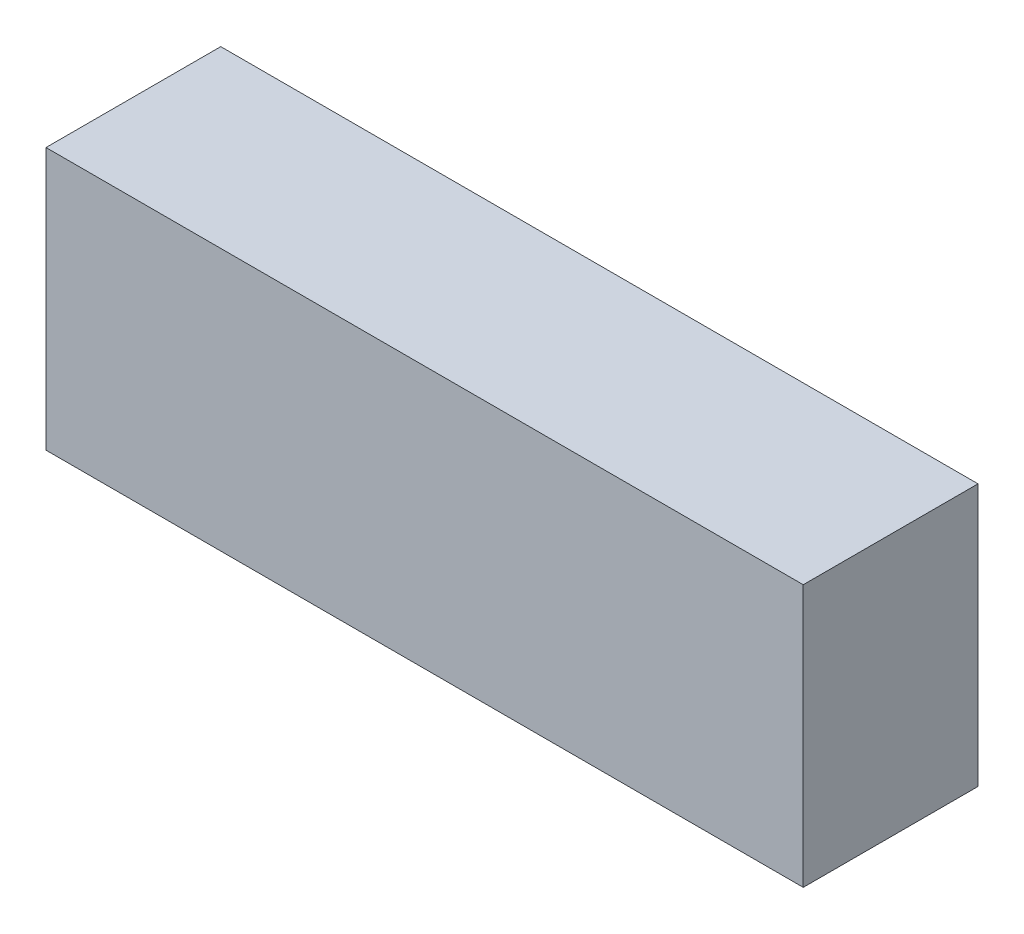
from build123d import *

# Parameters (mm, degrees)
ESQUISSE1_W             = 134
ESQUISSE1_H             = 50
EXTRUSION1_DEPTH        = 30
ESQUISSE2_W             = 134
ESQUISSE2_H             = 30
ENL_V_MAT_EXTRU_1_DEPTH = 5
ESQUISSE3_W             = 30
ESQUISSE3_H             = 45
ENL_V_MAT_EXTRU_2_DEPTH = 2
ESQUISSE4_W             = 30
ESQUISSE4_H             = 45
ENL_V_MAT_EXTRU_3_DEPTH = 2


with BuildPart() as part:
    # Esquisse1 → Extrusion1 (new body)
    with BuildSketch(Plane.XY):
        with Locations((67, 25)):
            Rectangle(ESQUISSE1_W, ESQUISSE1_H)
    extrude(amount=EXTRUSION1_DEPTH)

    # Esquisse2 → Enl_v. mat.-Extru.1 (cut)
    with BuildSketch(Plane(origin=(0, 50, 0), x_dir=(1, 0, 0), z_dir=(0, 1, 0))):
        with Locations((67, -15)):
            Rectangle(ESQUISSE2_W, ESQUISSE2_H)
    extrude(amount=-ENL_V_MAT_EXTRU_1_DEPTH, mode=Mode.SUBTRACT)

    # Esquisse3 → Enl_v. mat.-Extru.2 (cut)
    with BuildSketch(Plane.ZY):
        with Locations((15, 22.5)):
            Rectangle(ESQUISSE3_W, ESQUISSE3_H)
    extrude(amount=-ENL_V_MAT_EXTRU_2_DEPTH, mode=Mode.SUBTRACT)

    # Esquisse4 → Enl_v. mat.-Extru.3 (cut)
    with BuildSketch(Plane(origin=(134, 0, 0), x_dir=(0, 0, -1), z_dir=(1, 0, 0))):
        with Locations((-15, 22.5)):
            Rectangle(ESQUISSE4_W, ESQUISSE4_H)
    extrude(amount=-ENL_V_MAT_EXTRU_3_DEPTH, mode=Mode.SUBTRACT)


solid = part.part
